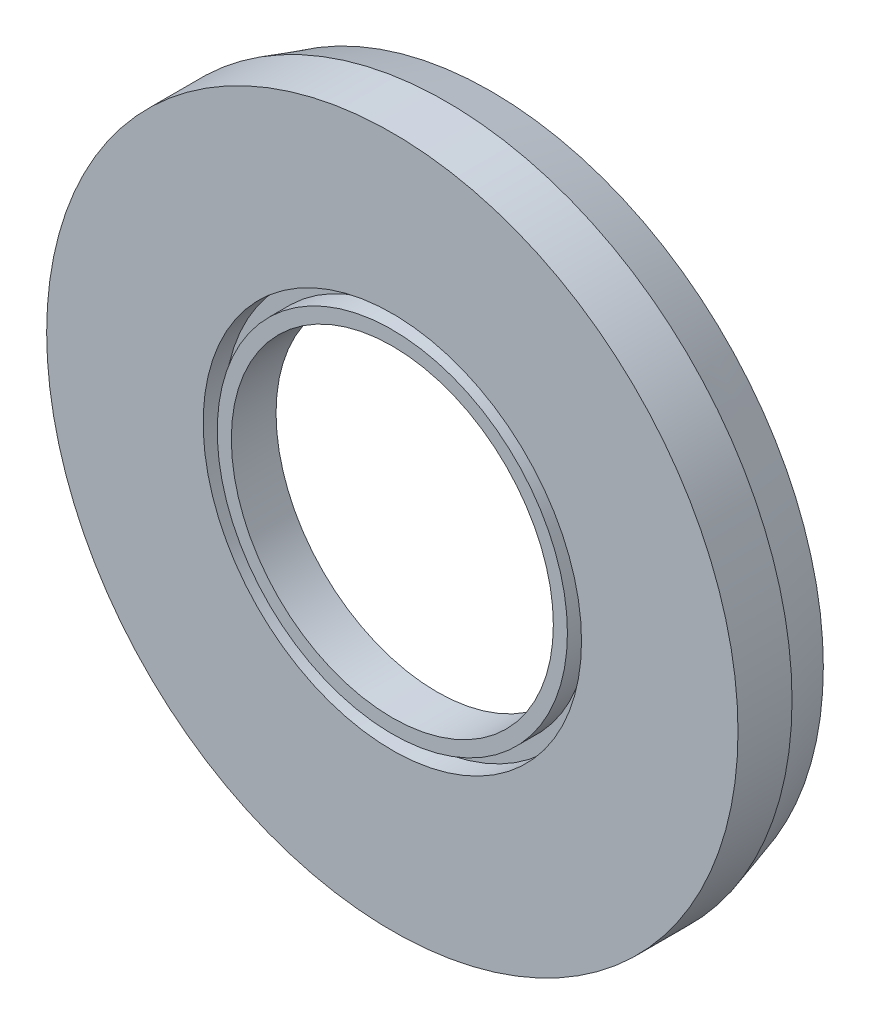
ISO-10303-21;
HEADER;
FILE_DESCRIPTION(('STEP AP214'),'2;1');
FILE_NAME('part.step','',(''),(''),'','','');
FILE_SCHEMA(('AUTOMOTIVE_DESIGN { 1 0 10303 214 1 1 1 1 }'));
ENDSEC;
DATA;
#1=APPLICATION_CONTEXT('core data for automotive mechanical design processes');
#2=APPLICATION_PROTOCOL_DEFINITION('international standard','automotive_design',2000,#1);
#3=PRODUCT_CONTEXT('',#1,'mechanical');
#4=PRODUCT('Part','Part','',(#3));
#5=PRODUCT_RELATED_PRODUCT_CATEGORY('part','',(#4));
#6=PRODUCT_DEFINITION_FORMATION('','',#4);
#7=PRODUCT_DEFINITION_CONTEXT('part definition',#1,'design');
#8=PRODUCT_DEFINITION('design','',#6,#7);
#9=PRODUCT_DEFINITION_SHAPE('','',#8);
#10=(LENGTH_UNIT() NAMED_UNIT(*) SI_UNIT(.MILLI.,.METRE.));
#11=(NAMED_UNIT(*) PLANE_ANGLE_UNIT() SI_UNIT($,.RADIAN.));
#12=(NAMED_UNIT(*) SI_UNIT($,.STERADIAN.) SOLID_ANGLE_UNIT());
#13=UNCERTAINTY_MEASURE_WITH_UNIT(LENGTH_MEASURE(1.E-05),#10,'distance_accuracy_value','');
#14=(GEOMETRIC_REPRESENTATION_CONTEXT(3) GLOBAL_UNCERTAINTY_ASSIGNED_CONTEXT((#13)) GLOBAL_UNIT_ASSIGNED_CONTEXT((#10,
#11,#12)) REPRESENTATION_CONTEXT('',''));
#15=CARTESIAN_POINT('',(0.,0.,0.));
#16=DIRECTION('',(0.,0.,1.));
#17=DIRECTION('',(1.,0.,0.));
#18=AXIS2_PLACEMENT_3D('',#15,#16,#17);
#19=CARTESIAN_POINT('',(0.,0.,3.175));
#20=DIRECTION('',(0.,0.,1.));
#21=DIRECTION('',(1.,0.,0.));
#22=AXIS2_PLACEMENT_3D('',#19,#20,#21);
#23=PLANE('',#22);
#24=CARTESIAN_POINT('',(0.,0.,3.175));
#25=DIRECTION('',(0.,0.,1.));
#26=DIRECTION('',(1.,0.,0.));
#27=AXIS2_PLACEMENT_3D('',#24,#25,#26);
#28=CIRCLE('',#27,11.43);
#29=CARTESIAN_POINT('',(11.43,0.,3.175));
#30=VERTEX_POINT('',#29);
#31=EDGE_CURVE('E39',#30,#30,#28,.T.);
#32=ORIENTED_EDGE('',*,*,#31,.F.);
#33=EDGE_LOOP('',(#32));
#34=FACE_BOUND('',#33,.T.);
#35=CARTESIAN_POINT('',(0.,0.,3.175));
#36=DIRECTION('',(0.,0.,1.));
#37=DIRECTION('',(1.,0.,0.));
#38=AXIS2_PLACEMENT_3D('',#35,#36,#37);
#39=CIRCLE('',#38,12.43);
#40=CARTESIAN_POINT('',(12.43,0.,3.175));
#41=VERTEX_POINT('',#40);
#42=EDGE_CURVE('E73',#41,#41,#39,.T.);
#43=ORIENTED_EDGE('',*,*,#42,.T.);
#44=EDGE_LOOP('',(#43));
#45=FACE_BOUND('',#44,.T.);
#46=ADVANCED_FACE('F28',(#34,#45),#23,.T.);
#47=CARTESIAN_POINT('',(0.,0.,0.));
#48=DIRECTION('',(0.,0.,1.));
#49=DIRECTION('',(1.,0.,0.));
#50=AXIS2_PLACEMENT_3D('',#47,#48,#49);
#51=PLANE('',#50);
#52=CARTESIAN_POINT('',(0.,0.,0.));
#53=DIRECTION('',(0.,0.,1.));
#54=DIRECTION('',(1.,0.,0.));
#55=AXIS2_PLACEMENT_3D('',#52,#53,#54);
#56=CIRCLE('',#55,11.43);
#57=CARTESIAN_POINT('',(11.43,0.,0.));
#58=VERTEX_POINT('',#57);
#59=EDGE_CURVE('E43',#58,#58,#56,.T.);
#60=ORIENTED_EDGE('',*,*,#59,.T.);
#61=EDGE_LOOP('',(#60));
#62=FACE_BOUND('',#61,.T.);
#63=CARTESIAN_POINT('',(0.,0.,0.));
#64=DIRECTION('',(0.,0.,1.));
#65=DIRECTION('',(1.,0.,0.));
#66=AXIS2_PLACEMENT_3D('',#63,#64,#65);
#67=CIRCLE('',#66,21.36394);
#68=CARTESIAN_POINT('',(21.36394,0.,0.));
#69=VERTEX_POINT('',#68);
#70=EDGE_CURVE('E10',#69,#69,#67,.T.);
#71=ORIENTED_EDGE('',*,*,#70,.F.);
#72=EDGE_LOOP('',(#71));
#73=FACE_BOUND('',#72,.T.);
#74=ADVANCED_FACE('F97',(#62,#73),#51,.F.);
#75=CARTESIAN_POINT('',(0.,0.,3.175));
#76=DIRECTION('',(0.,0.,1.));
#77=DIRECTION('',(1.,0.,0.));
#78=AXIS2_PLACEMENT_3D('',#75,#76,#77);
#79=CIRCLE('',#78,13.43);
#80=CARTESIAN_POINT('',(13.43,0.,3.175));
#81=VERTEX_POINT('',#80);
#82=EDGE_CURVE('E67',#81,#81,#79,.T.);
#83=ORIENTED_EDGE('',*,*,#82,.F.);
#84=EDGE_LOOP('',(#83));
#85=FACE_BOUND('',#84,.T.);
#86=CARTESIAN_POINT('',(0.,0.,3.175));
#87=DIRECTION('',(0.,0.,1.));
#88=DIRECTION('',(1.,0.,0.));
#89=AXIS2_PLACEMENT_3D('',#86,#87,#88);
#90=CIRCLE('',#89,24.53894);
#91=CARTESIAN_POINT('',(24.53894,0.,3.175));
#92=VERTEX_POINT('',#91);
#93=EDGE_CURVE('E35',#92,#92,#90,.T.);
#94=ORIENTED_EDGE('',*,*,#93,.T.);
#95=EDGE_LOOP('',(#94));
#96=FACE_BOUND('',#95,.T.);
#97=ADVANCED_FACE('F95',(#85,#96),#23,.T.);
#98=CARTESIAN_POINT('',(0.,0.,3.175));
#99=DIRECTION('',(0.,0.,-1.));
#100=DIRECTION('',(-1.,0.,0.));
#101=AXIS2_PLACEMENT_3D('',#98,#99,#100);
#102=CYLINDRICAL_SURFACE('',#101,24.53894);
#103=ORIENTED_EDGE('',*,*,#93,.F.);
#104=EDGE_LOOP('',(#103));
#105=FACE_BOUND('',#104,.T.);
#106=CARTESIAN_POINT('',(0.,0.,-0.6604));
#107=DIRECTION('',(0.,0.,1.));
#108=DIRECTION('',(1.,0.,0.));
#109=AXIS2_PLACEMENT_3D('',#106,#107,#108);
#110=CIRCLE('',#109,24.53894);
#111=CARTESIAN_POINT('',(24.53894,0.,-0.6604));
#112=VERTEX_POINT('',#111);
#113=EDGE_CURVE('E63',#112,#112,#110,.T.);
#114=ORIENTED_EDGE('',*,*,#113,.T.);
#115=EDGE_LOOP('',(#114));
#116=FACE_BOUND('',#115,.T.);
#117=ADVANCED_FACE('F30',(#105,#116),#102,.T.);
#118=CARTESIAN_POINT('',(0.,0.,3.175));
#119=DIRECTION('',(0.,0.,-1.));
#120=DIRECTION('',(-1.,0.,0.));
#121=AXIS2_PLACEMENT_3D('',#118,#119,#120);
#122=CYLINDRICAL_SURFACE('',#121,11.43);
#123=ORIENTED_EDGE('',*,*,#31,.T.);
#124=EDGE_LOOP('',(#123));
#125=FACE_BOUND('',#124,.T.);
#126=ORIENTED_EDGE('',*,*,#59,.F.);
#127=EDGE_LOOP('',(#126));
#128=FACE_BOUND('',#127,.T.);
#129=ADVANCED_FACE('F103',(#125,#128),#122,.F.);
#130=CARTESIAN_POINT('',(0.,0.,3.175));
#131=DIRECTION('',(0.,0.,1.));
#132=DIRECTION('',(1.,0.,0.));
#133=AXIS2_PLACEMENT_3D('',#130,#131,#132);
#134=CYLINDRICAL_SURFACE('',#133,21.36394);
#135=CARTESIAN_POINT('',(0.,0.,-0.6604));
#136=DIRECTION('',(0.,0.,1.));
#137=DIRECTION('',(1.,0.,0.));
#138=AXIS2_PLACEMENT_3D('',#135,#136,#137);
#139=CIRCLE('',#138,21.36394);
#140=CARTESIAN_POINT('',(21.36394,0.,-0.6604));
#141=VERTEX_POINT('',#140);
#142=EDGE_CURVE('E47',#141,#141,#139,.T.);
#143=ORIENTED_EDGE('',*,*,#142,.F.);
#144=EDGE_LOOP('',(#143));
#145=FACE_BOUND('',#144,.T.);
#146=ORIENTED_EDGE('',*,*,#70,.T.);
#147=EDGE_LOOP('',(#146));
#148=FACE_BOUND('',#147,.T.);
#149=ADVANCED_FACE('F137',(#145,#148),#134,.F.);
#150=CARTESIAN_POINT('',(0.,0.,-0.6604));
#151=DIRECTION('',(0.,0.,-1.));
#152=DIRECTION('',(-1.,0.,0.));
#153=AXIS2_PLACEMENT_3D('',#150,#151,#152);
#154=CONICAL_SURFACE('',#153,21.36394,0.291456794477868);
#155=CARTESIAN_POINT('',(0.,0.,-3.8354));
#156=DIRECTION('',(0.,0.,1.));
#157=DIRECTION('',(1.,0.,0.));
#158=AXIS2_PLACEMENT_3D('',#155,#156,#157);
#159=CIRCLE('',#158,22.31644);
#160=CARTESIAN_POINT('',(22.31644,0.,-3.8354));
#161=VERTEX_POINT('',#160);
#162=EDGE_CURVE('E51',#161,#161,#159,.T.);
#163=ORIENTED_EDGE('',*,*,#162,.F.);
#164=EDGE_LOOP('',(#163));
#165=FACE_BOUND('',#164,.T.);
#166=ORIENTED_EDGE('',*,*,#142,.T.);
#167=EDGE_LOOP('',(#166));
#168=FACE_BOUND('',#167,.T.);
#169=ADVANCED_FACE('F133',(#165,#168),#154,.F.);
#170=CARTESIAN_POINT('',(0.,0.,3.175));
#171=DIRECTION('',(0.,0.,1.));
#172=DIRECTION('',(1.,0.,0.));
#173=AXIS2_PLACEMENT_3D('',#170,#171,#172);
#174=CYLINDRICAL_SURFACE('',#173,22.31644);
#175=CARTESIAN_POINT('',(0.,0.,-0.0254000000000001));
#176=DIRECTION('',(0.,0.,1.));
#177=DIRECTION('',(1.,0.,0.));
#178=AXIS2_PLACEMENT_3D('',#175,#176,#177);
#179=CIRCLE('',#178,22.31644);
#180=CARTESIAN_POINT('',(22.31644,0.,-0.0254000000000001));
#181=VERTEX_POINT('',#180);
#182=EDGE_CURVE('E54',#181,#181,#179,.T.);
#183=ORIENTED_EDGE('',*,*,#182,.F.);
#184=EDGE_LOOP('',(#183));
#185=FACE_BOUND('',#184,.T.);
#186=ORIENTED_EDGE('',*,*,#162,.T.);
#187=EDGE_LOOP('',(#186));
#188=FACE_BOUND('',#187,.T.);
#189=ADVANCED_FACE('F129',(#185,#188),#174,.T.);
#190=CARTESIAN_POINT('',(-23.58644,0.,-0.0254000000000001));
#191=DIRECTION('',(0.,0.,1.));
#192=DIRECTION('',(1.,0.,0.));
#193=AXIS2_PLACEMENT_3D('',#190,#191,#192);
#194=PLANE('',#193);
#195=CARTESIAN_POINT('',(0.,0.,-0.0254000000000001));
#196=DIRECTION('',(0.,0.,1.));
#197=DIRECTION('',(1.,0.,0.));
#198=AXIS2_PLACEMENT_3D('',#195,#196,#197);
#199=CIRCLE('',#198,23.58644);
#200=CARTESIAN_POINT('',(23.58644,0.,-0.0254000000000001));
#201=VERTEX_POINT('',#200);
#202=EDGE_CURVE('E57',#201,#201,#199,.T.);
#203=ORIENTED_EDGE('',*,*,#202,.F.);
#204=EDGE_LOOP('',(#203));
#205=FACE_BOUND('',#204,.T.);
#206=ORIENTED_EDGE('',*,*,#182,.T.);
#207=EDGE_LOOP('',(#206));
#208=FACE_BOUND('',#207,.T.);
#209=ADVANCED_FACE('F125',(#205,#208),#194,.F.);
#210=CARTESIAN_POINT('',(0.,0.,3.175));
#211=DIRECTION('',(0.,0.,1.));
#212=DIRECTION('',(1.,0.,0.));
#213=AXIS2_PLACEMENT_3D('',#210,#211,#212);
#214=CYLINDRICAL_SURFACE('',#213,23.58644);
#215=CARTESIAN_POINT('',(0.,0.,-3.8354));
#216=DIRECTION('',(0.,0.,1.));
#217=DIRECTION('',(1.,0.,0.));
#218=AXIS2_PLACEMENT_3D('',#215,#216,#217);
#219=CIRCLE('',#218,23.58644);
#220=CARTESIAN_POINT('',(23.58644,0.,-3.8354));
#221=VERTEX_POINT('',#220);
#222=EDGE_CURVE('E60',#221,#221,#219,.T.);
#223=ORIENTED_EDGE('',*,*,#222,.F.);
#224=EDGE_LOOP('',(#223));
#225=FACE_BOUND('',#224,.T.);
#226=ORIENTED_EDGE('',*,*,#202,.T.);
#227=EDGE_LOOP('',(#226));
#228=FACE_BOUND('',#227,.T.);
#229=ADVANCED_FACE('F121',(#225,#228),#214,.F.);
#230=CARTESIAN_POINT('',(0.,0.,-3.8354));
#231=DIRECTION('',(0.,0.,1.));
#232=DIRECTION('',(1.,0.,0.));
#233=AXIS2_PLACEMENT_3D('',#230,#231,#232);
#234=CONICAL_SURFACE('',#233,23.58644,0.291456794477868);
#235=ORIENTED_EDGE('',*,*,#113,.F.);
#236=EDGE_LOOP('',(#235));
#237=FACE_BOUND('',#236,.T.);
#238=ORIENTED_EDGE('',*,*,#222,.T.);
#239=EDGE_LOOP('',(#238));
#240=FACE_BOUND('',#239,.T.);
#241=ADVANCED_FACE('F91',(#237,#240),#234,.T.);
#242=CARTESIAN_POINT('',(0.,0.,1.675));
#243=DIRECTION('',(0.,0.,1.));
#244=DIRECTION('',(1.,0.,0.));
#245=AXIS2_PLACEMENT_3D('',#242,#243,#244);
#246=CYLINDRICAL_SURFACE('',#245,13.43);
#247=CARTESIAN_POINT('',(0.,0.,1.675));
#248=DIRECTION('',(0.,0.,1.));
#249=DIRECTION('',(1.,0.,0.));
#250=AXIS2_PLACEMENT_3D('',#247,#248,#249);
#251=CIRCLE('',#250,13.43);
#252=CARTESIAN_POINT('',(13.43,0.,1.675));
#253=VERTEX_POINT('',#252);
#254=EDGE_CURVE('E66',#253,#253,#251,.T.);
#255=ORIENTED_EDGE('',*,*,#254,.F.);
#256=EDGE_LOOP('',(#255));
#257=FACE_BOUND('',#256,.T.);
#258=ORIENTED_EDGE('',*,*,#82,.T.);
#259=EDGE_LOOP('',(#258));
#260=FACE_BOUND('',#259,.T.);
#261=ADVANCED_FACE('F85',(#257,#260),#246,.F.);
#262=CARTESIAN_POINT('',(0.,0.,1.675));
#263=DIRECTION('',(0.,0.,1.));
#264=DIRECTION('',(1.,0.,0.));
#265=AXIS2_PLACEMENT_3D('',#262,#263,#264);
#266=PLANE('',#265);
#267=CARTESIAN_POINT('',(0.,0.,1.675));
#268=DIRECTION('',(0.,0.,1.));
#269=DIRECTION('',(1.,0.,0.));
#270=AXIS2_PLACEMENT_3D('',#267,#268,#269);
#271=CIRCLE('',#270,12.43);
#272=CARTESIAN_POINT('',(12.43,0.,1.675));
#273=VERTEX_POINT('',#272);
#274=EDGE_CURVE('E70',#273,#273,#271,.T.);
#275=ORIENTED_EDGE('',*,*,#274,.F.);
#276=EDGE_LOOP('',(#275));
#277=FACE_BOUND('',#276,.T.);
#278=ORIENTED_EDGE('',*,*,#254,.T.);
#279=EDGE_LOOP('',(#278));
#280=FACE_BOUND('',#279,.T.);
#281=ADVANCED_FACE('F82',(#277,#280),#266,.T.);
#282=CARTESIAN_POINT('',(0.,0.,1.675));
#283=DIRECTION('',(0.,0.,1.));
#284=DIRECTION('',(1.,0.,0.));
#285=AXIS2_PLACEMENT_3D('',#282,#283,#284);
#286=CYLINDRICAL_SURFACE('',#285,12.43);
#287=ORIENTED_EDGE('',*,*,#274,.T.);
#288=EDGE_LOOP('',(#287));
#289=FACE_BOUND('',#288,.T.);
#290=ORIENTED_EDGE('',*,*,#42,.F.);
#291=EDGE_LOOP('',(#290));
#292=FACE_BOUND('',#291,.T.);
#293=ADVANCED_FACE('F79',(#289,#292),#286,.T.);
#294=CLOSED_SHELL('',(#46,#74,#97,#117,#129,#149,#169,#189,#209,#229,#241,#261,#281,#293));
#295=MANIFOLD_SOLID_BREP('B2',#294);
#296=ADVANCED_BREP_SHAPE_REPRESENTATION('',(#18,#295),#14);
#297=SHAPE_DEFINITION_REPRESENTATION(#9,#296);
ENDSEC;
END-ISO-10303-21;
